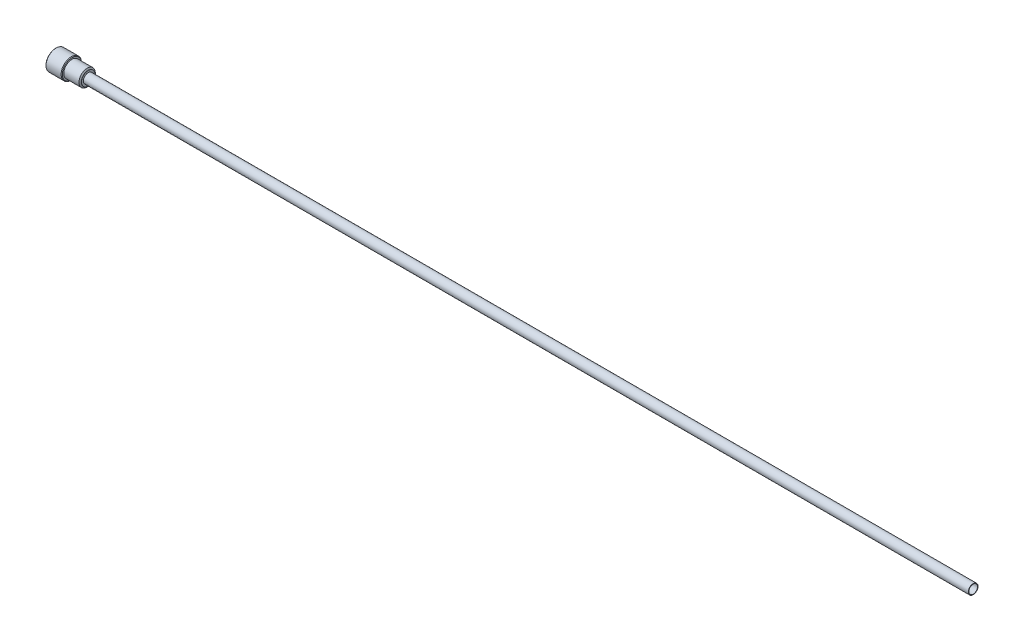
ISO-10303-21;
HEADER;
FILE_DESCRIPTION(('STEP AP214'),'2;1');
FILE_NAME('part.step','',(''),(''),'','','');
FILE_SCHEMA(('AUTOMOTIVE_DESIGN { 1 0 10303 214 1 1 1 1 }'));
ENDSEC;
DATA;
#1=APPLICATION_CONTEXT('core data for automotive mechanical design processes');
#2=APPLICATION_PROTOCOL_DEFINITION('international standard','automotive_design',2000,#1);
#3=PRODUCT_CONTEXT('',#1,'mechanical');
#4=PRODUCT('Part','Part','',(#3));
#5=PRODUCT_RELATED_PRODUCT_CATEGORY('part','',(#4));
#6=PRODUCT_DEFINITION_FORMATION('','',#4);
#7=PRODUCT_DEFINITION_CONTEXT('part definition',#1,'design');
#8=PRODUCT_DEFINITION('design','',#6,#7);
#9=PRODUCT_DEFINITION_SHAPE('','',#8);
#10=(LENGTH_UNIT() NAMED_UNIT(*) SI_UNIT(.MILLI.,.METRE.));
#11=(NAMED_UNIT(*) PLANE_ANGLE_UNIT() SI_UNIT($,.RADIAN.));
#12=(NAMED_UNIT(*) SI_UNIT($,.STERADIAN.) SOLID_ANGLE_UNIT());
#13=UNCERTAINTY_MEASURE_WITH_UNIT(LENGTH_MEASURE(1.E-05),#10,'distance_accuracy_value','');
#14=(GEOMETRIC_REPRESENTATION_CONTEXT(3) GLOBAL_UNCERTAINTY_ASSIGNED_CONTEXT((#13)) GLOBAL_UNIT_ASSIGNED_CONTEXT((#10,
#11,#12)) REPRESENTATION_CONTEXT('',''));
#15=CARTESIAN_POINT('',(0.,0.,0.));
#16=DIRECTION('',(0.,0.,1.));
#17=DIRECTION('',(1.,0.,0.));
#18=AXIS2_PLACEMENT_3D('',#15,#16,#17);
#19=CARTESIAN_POINT('',(-22.2121854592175,0.,0.));
#20=DIRECTION('',(-1.,0.,0.));
#21=DIRECTION('',(0.,0.,1.));
#22=AXIS2_PLACEMENT_3D('',#19,#20,#21);
#23=CYLINDRICAL_SURFACE('',#22,3.295);
#24=CARTESIAN_POINT('',(15.9,0.,0.));
#25=DIRECTION('',(-1.,0.,0.));
#26=DIRECTION('',(0.,0.,1.));
#27=AXIS2_PLACEMENT_3D('',#24,#25,#26);
#28=CIRCLE('',#27,3.295);
#29=CARTESIAN_POINT('',(15.9,0.,3.295));
#30=VERTEX_POINT('',#29);
#31=EDGE_CURVE('E115',#30,#30,#28,.T.);
#32=ORIENTED_EDGE('',*,*,#31,.F.);
#33=EDGE_LOOP('',(#32));
#34=FACE_BOUND('',#33,.T.);
#35=CARTESIAN_POINT('',(16.,0.,0.));
#36=DIRECTION('',(-1.,0.,0.));
#37=DIRECTION('',(0.,0.,1.));
#38=AXIS2_PLACEMENT_3D('',#35,#36,#37);
#39=CIRCLE('',#38,3.295);
#40=CARTESIAN_POINT('',(16.,0.,3.295));
#41=VERTEX_POINT('',#40);
#42=EDGE_CURVE('E133',#41,#41,#39,.T.);
#43=ORIENTED_EDGE('',*,*,#42,.T.);
#44=EDGE_LOOP('',(#43));
#45=FACE_BOUND('',#44,.T.);
#46=ADVANCED_FACE('F33',(#34,#45),#23,.T.);
#47=CARTESIAN_POINT('',(16.,3.295,0.));
#48=DIRECTION('',(-1.,0.,0.));
#49=DIRECTION('',(0.,0.,1.));
#50=AXIS2_PLACEMENT_3D('',#47,#48,#49);
#51=PLANE('',#50);
#52=ORIENTED_EDGE('',*,*,#42,.F.);
#53=EDGE_LOOP('',(#52));
#54=FACE_BOUND('',#53,.T.);
#55=CARTESIAN_POINT('',(16.,0.,0.));
#56=DIRECTION('',(-1.,0.,0.));
#57=DIRECTION('',(0.,0.,1.));
#58=AXIS2_PLACEMENT_3D('',#55,#56,#57);
#59=CIRCLE('',#58,2.3749);
#60=CARTESIAN_POINT('',(16.,0.,2.3749));
#61=VERTEX_POINT('',#60);
#62=EDGE_CURVE('E130',#61,#61,#59,.T.);
#63=ORIENTED_EDGE('',*,*,#62,.T.);
#64=EDGE_LOOP('',(#63));
#65=FACE_BOUND('',#64,.T.);
#66=ADVANCED_FACE('F272',(#54,#65),#51,.F.);
#67=CARTESIAN_POINT('',(-22.2121854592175,0.,0.));
#68=DIRECTION('',(-1.,0.,0.));
#69=DIRECTION('',(0.,0.,1.));
#70=AXIS2_PLACEMENT_3D('',#67,#68,#69);
#71=CYLINDRICAL_SURFACE('',#70,2.3749);
#72=ORIENTED_EDGE('',*,*,#62,.F.);
#73=EDGE_LOOP('',(#72));
#74=FACE_BOUND('',#73,.T.);
#75=CARTESIAN_POINT('',(450.,0.,0.));
#76=DIRECTION('',(-1.,0.,0.));
#77=DIRECTION('',(0.,0.,1.));
#78=AXIS2_PLACEMENT_3D('',#75,#76,#77);
#79=CIRCLE('',#78,2.3749);
#80=CARTESIAN_POINT('',(450.,0.,2.3749));
#81=VERTEX_POINT('',#80);
#82=EDGE_CURVE('E127',#81,#81,#79,.T.);
#83=ORIENTED_EDGE('',*,*,#82,.T.);
#84=EDGE_LOOP('',(#83));
#85=FACE_BOUND('',#84,.T.);
#86=ADVANCED_FACE('F278',(#74,#85),#71,.T.);
#87=CARTESIAN_POINT('',(450.,2.3749,0.));
#88=DIRECTION('',(-1.,0.,0.));
#89=DIRECTION('',(0.,0.,1.));
#90=AXIS2_PLACEMENT_3D('',#87,#88,#89);
#91=PLANE('',#90);
#92=ORIENTED_EDGE('',*,*,#82,.F.);
#93=EDGE_LOOP('',(#92));
#94=FACE_BOUND('',#93,.T.);
#95=CARTESIAN_POINT('',(450.,0.,0.));
#96=DIRECTION('',(-1.,0.,0.));
#97=DIRECTION('',(0.,0.,1.));
#98=AXIS2_PLACEMENT_3D('',#95,#96,#97);
#99=CIRCLE('',#98,2.12090000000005);
#100=CARTESIAN_POINT('',(450.,0.,2.12090000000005));
#101=VERTEX_POINT('',#100);
#102=EDGE_CURVE('E124',#101,#101,#99,.T.);
#103=ORIENTED_EDGE('',*,*,#102,.T.);
#104=EDGE_LOOP('',(#103));
#105=FACE_BOUND('',#104,.T.);
#106=ADVANCED_FACE('F286',(#94,#105),#91,.F.);
#107=CARTESIAN_POINT('',(-22.2121854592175,0.,0.));
#108=DIRECTION('',(-1.,0.,0.));
#109=DIRECTION('',(0.,0.,1.));
#110=AXIS2_PLACEMENT_3D('',#107,#108,#109);
#111=CYLINDRICAL_SURFACE('',#110,2.12090000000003);
#112=CARTESIAN_POINT('',(5.02821657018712,0.,0.));
#113=DIRECTION('',(-1.,0.,0.));
#114=DIRECTION('',(0.,0.,1.));
#115=AXIS2_PLACEMENT_3D('',#112,#113,#114);
#116=CIRCLE('',#115,2.12090000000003);
#117=CARTESIAN_POINT('',(5.02821657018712,0.,2.12090000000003));
#118=VERTEX_POINT('',#117);
#119=EDGE_CURVE('E114',#118,#118,#116,.T.);
#120=ORIENTED_EDGE('',*,*,#119,.T.);
#121=EDGE_LOOP('',(#120));
#122=FACE_BOUND('',#121,.T.);
#123=ORIENTED_EDGE('',*,*,#102,.F.);
#124=EDGE_LOOP('',(#123));
#125=FACE_BOUND('',#124,.T.);
#126=ADVANCED_FACE('F258',(#122,#125),#111,.F.);
#127=CARTESIAN_POINT('',(0.,2.1209,0.));
#128=DIRECTION('',(1.,0.,0.));
#129=DIRECTION('',(0.,0.,-1.));
#130=AXIS2_PLACEMENT_3D('',#127,#128,#129);
#131=PLANE('',#130);
#132=CARTESIAN_POINT('',(0.,0.,0.));
#133=DIRECTION('',(1.,0.,0.));
#134=DIRECTION('',(0.,0.,-1.));
#135=AXIS2_PLACEMENT_3D('',#132,#133,#134);
#136=CIRCLE('',#135,3.59999999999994);
#137=CARTESIAN_POINT('',(0.,0.,-3.59999999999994));
#138=VERTEX_POINT('',#137);
#139=EDGE_CURVE('E148',#138,#138,#136,.T.);
#140=ORIENTED_EDGE('',*,*,#139,.T.);
#141=EDGE_LOOP('',(#140));
#142=FACE_BOUND('',#141,.T.);
#143=CARTESIAN_POINT('',(0.,0.,0.));
#144=DIRECTION('',(1.,0.,0.));
#145=DIRECTION('',(0.,0.,-1.));
#146=AXIS2_PLACEMENT_3D('',#143,#144,#145);
#147=CIRCLE('',#146,4.70000000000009);
#148=CARTESIAN_POINT('',(0.,0.,-4.70000000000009));
#149=VERTEX_POINT('',#148);
#150=EDGE_CURVE('E145',#149,#149,#147,.F.);
#151=ORIENTED_EDGE('',*,*,#150,.T.);
#152=EDGE_LOOP('',(#151));
#153=FACE_BOUND('',#152,.T.);
#154=ADVANCED_FACE('F254',(#142,#153),#131,.F.);
#155=CARTESIAN_POINT('',(-22.2121854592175,0.,0.));
#156=DIRECTION('',(-1.,0.,0.));
#157=DIRECTION('',(0.,0.,1.));
#158=AXIS2_PLACEMENT_3D('',#155,#156,#157);
#159=CYLINDRICAL_SURFACE('',#158,5.);
#160=CARTESIAN_POINT('',(7.69999999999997,0.,0.));
#161=DIRECTION('',(-1.,0.,0.));
#162=DIRECTION('',(0.,0.,1.));
#163=AXIS2_PLACEMENT_3D('',#160,#161,#162);
#164=CIRCLE('',#163,5.);
#165=CARTESIAN_POINT('',(7.69999999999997,0.,5.));
#166=VERTEX_POINT('',#165);
#167=EDGE_CURVE('E139',#166,#166,#164,.T.);
#168=ORIENTED_EDGE('',*,*,#167,.T.);
#169=EDGE_LOOP('',(#168));
#170=FACE_BOUND('',#169,.T.);
#171=CARTESIAN_POINT('',(0.299999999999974,0.,0.));
#172=DIRECTION('',(1.,0.,0.));
#173=DIRECTION('',(0.,0.,-1.));
#174=AXIS2_PLACEMENT_3D('',#171,#172,#173);
#175=CIRCLE('',#174,5.);
#176=CARTESIAN_POINT('',(0.299999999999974,0.,-5.));
#177=VERTEX_POINT('',#176);
#178=EDGE_CURVE('E136',#177,#177,#175,.T.);
#179=ORIENTED_EDGE('',*,*,#178,.T.);
#180=EDGE_LOOP('',(#179));
#181=FACE_BOUND('',#180,.T.);
#182=ADVANCED_FACE('F257',(#170,#181),#159,.T.);
#183=CARTESIAN_POINT('',(8.,4.,0.));
#184=DIRECTION('',(-1.,0.,0.));
#185=DIRECTION('',(0.,0.,1.));
#186=AXIS2_PLACEMENT_3D('',#183,#184,#185);
#187=PLANE('',#186);
#188=CARTESIAN_POINT('',(8.,0.,0.));
#189=DIRECTION('',(-1.,0.,0.));
#190=DIRECTION('',(0.,0.,1.));
#191=AXIS2_PLACEMENT_3D('',#188,#189,#190);
#192=CIRCLE('',#191,4.69999999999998);
#193=CARTESIAN_POINT('',(8.,0.,4.69999999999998));
#194=VERTEX_POINT('',#193);
#195=EDGE_CURVE('E142',#194,#194,#192,.F.);
#196=ORIENTED_EDGE('',*,*,#195,.T.);
#197=EDGE_LOOP('',(#196));
#198=FACE_BOUND('',#197,.T.);
#199=CARTESIAN_POINT('',(8.,0.,0.));
#200=DIRECTION('',(-1.,0.,0.));
#201=DIRECTION('',(0.,0.,1.));
#202=AXIS2_PLACEMENT_3D('',#199,#200,#201);
#203=CIRCLE('',#202,4.);
#204=CARTESIAN_POINT('',(8.,0.,4.));
#205=VERTEX_POINT('',#204);
#206=EDGE_CURVE('E121',#205,#205,#203,.T.);
#207=ORIENTED_EDGE('',*,*,#206,.T.);
#208=EDGE_LOOP('',(#207));
#209=FACE_BOUND('',#208,.T.);
#210=ADVANCED_FACE('F296',(#198,#209),#187,.F.);
#211=CARTESIAN_POINT('',(-22.2121854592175,0.,0.));
#212=DIRECTION('',(-1.,0.,0.));
#213=DIRECTION('',(0.,0.,1.));
#214=AXIS2_PLACEMENT_3D('',#211,#212,#213);
#215=CYLINDRICAL_SURFACE('',#214,4.);
#216=ORIENTED_EDGE('',*,*,#206,.F.);
#217=EDGE_LOOP('',(#216));
#218=FACE_BOUND('',#217,.T.);
#219=CARTESIAN_POINT('',(15.4929680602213,0.,0.));
#220=DIRECTION('',(-1.,0.,0.));
#221=DIRECTION('',(0.,0.,1.));
#222=AXIS2_PLACEMENT_3D('',#219,#220,#221);
#223=CIRCLE('',#222,4.);
#224=CARTESIAN_POINT('',(15.4929680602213,0.,4.));
#225=VERTEX_POINT('',#224);
#226=EDGE_CURVE('E118',#225,#225,#223,.T.);
#227=ORIENTED_EDGE('',*,*,#226,.T.);
#228=EDGE_LOOP('',(#227));
#229=FACE_BOUND('',#228,.T.);
#230=ADVANCED_FACE('F299',(#218,#229),#215,.T.);
#231=CARTESIAN_POINT('',(15.9,0.,0.));
#232=DIRECTION('',(-1.,0.,0.));
#233=DIRECTION('',(0.,0.,1.));
#234=AXIS2_PLACEMENT_3D('',#231,#232,#233);
#235=CONICAL_SURFACE('',#234,3.295,1.04719755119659);
#236=ORIENTED_EDGE('',*,*,#226,.F.);
#237=EDGE_LOOP('',(#236));
#238=FACE_BOUND('',#237,.T.);
#239=ORIENTED_EDGE('',*,*,#31,.T.);
#240=EDGE_LOOP('',(#239));
#241=FACE_BOUND('',#240,.T.);
#242=ADVANCED_FACE('F195',(#238,#241),#235,.T.);
#243=CARTESIAN_POINT('',(7.69999999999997,0.,0.));
#244=DIRECTION('',(-1.,0.,0.));
#245=DIRECTION('',(0.,0.,1.));
#246=AXIS2_PLACEMENT_3D('',#243,#244,#245);
#247=CONICAL_SURFACE('',#246,5.,0.785398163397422);
#248=ORIENTED_EDGE('',*,*,#195,.F.);
#249=EDGE_LOOP('',(#248));
#250=FACE_BOUND('',#249,.T.);
#251=ORIENTED_EDGE('',*,*,#167,.F.);
#252=EDGE_LOOP('',(#251));
#253=FACE_BOUND('',#252,.T.);
#254=ADVANCED_FACE('F263',(#250,#253),#247,.T.);
#255=CARTESIAN_POINT('',(0.,0.,0.));
#256=DIRECTION('',(1.,0.,0.));
#257=DIRECTION('',(0.,0.,-1.));
#258=AXIS2_PLACEMENT_3D('',#255,#256,#257);
#259=CONICAL_SURFACE('',#258,4.70000000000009,0.785398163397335);
#260=CARTESIAN_POINT('',(0.299999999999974,0.,-5.));
#261=CARTESIAN_POINT('',(0.296874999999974,0.,-4.996875));
#262=CARTESIAN_POINT('',(0.293749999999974,0.,-4.99375));
#263=CARTESIAN_POINT('',(0.287499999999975,0.,-4.9875));
#264=CARTESIAN_POINT('',(0.284374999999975,0.,-4.984375));
#265=CARTESIAN_POINT('',(0.278124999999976,0.,-4.97812500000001));
#266=CARTESIAN_POINT('',(0.274999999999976,0.,-4.97500000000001));
#267=CARTESIAN_POINT('',(0.268749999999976,0.,-4.96875000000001));
#268=CARTESIAN_POINT('',(0.265624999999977,0.,-4.96562500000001));
#269=CARTESIAN_POINT('',(0.259374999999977,0.,-4.95937500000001));
#270=CARTESIAN_POINT('',(0.256249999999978,0.,-4.95625000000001));
#271=CARTESIAN_POINT('',(0.249999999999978,0.,-4.95000000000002));
#272=CARTESIAN_POINT('',(0.246874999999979,0.,-4.94687500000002));
#273=CARTESIAN_POINT('',(0.240624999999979,0.,-4.94062500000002));
#274=CARTESIAN_POINT('',(0.237499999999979,0.,-4.93750000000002));
#275=CARTESIAN_POINT('',(0.23124999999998,0.,-4.93125000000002));
#276=CARTESIAN_POINT('',(0.22812499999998,0.,-4.92812500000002));
#277=CARTESIAN_POINT('',(0.221874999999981,0.,-4.92187500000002));
#278=CARTESIAN_POINT('',(0.218749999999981,0.,-4.91875000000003));
#279=CARTESIAN_POINT('',(0.212499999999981,0.,-4.91250000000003));
#280=CARTESIAN_POINT('',(0.209374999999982,0.,-4.90937500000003));
#281=CARTESIAN_POINT('',(0.203124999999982,0.,-4.90312500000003));
#282=CARTESIAN_POINT('',(0.199999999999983,0.,-4.90000000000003));
#283=CARTESIAN_POINT('',(0.193749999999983,0.,-4.89375000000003));
#284=CARTESIAN_POINT('',(0.190624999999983,0.,-4.89062500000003));
#285=CARTESIAN_POINT('',(0.184374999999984,0.,-4.88437500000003));
#286=CARTESIAN_POINT('',(0.181249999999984,0.,-4.88125000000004));
#287=CARTESIAN_POINT('',(0.174999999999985,0.,-4.87500000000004));
#288=CARTESIAN_POINT('',(0.171874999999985,0.,-4.87187500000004));
#289=CARTESIAN_POINT('',(0.165624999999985,0.,-4.86562500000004));
#290=CARTESIAN_POINT('',(0.162499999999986,0.,-4.86250000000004));
#291=CARTESIAN_POINT('',(0.156249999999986,0.,-4.85625000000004));
#292=CARTESIAN_POINT('',(0.153124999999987,0.,-4.85312500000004));
#293=CARTESIAN_POINT('',(0.146874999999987,0.,-4.84687500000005));
#294=CARTESIAN_POINT('',(0.143749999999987,0.,-4.84375000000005));
#295=CARTESIAN_POINT('',(0.137499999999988,0.,-4.83750000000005));
#296=CARTESIAN_POINT('',(0.134374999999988,0.,-4.83437500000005));
#297=CARTESIAN_POINT('',(0.128124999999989,0.,-4.82812500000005));
#298=CARTESIAN_POINT('',(0.124999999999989,0.,-4.82500000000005));
#299=CARTESIAN_POINT('',(0.11874999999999,0.,-4.81875000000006));
#300=CARTESIAN_POINT('',(0.11562499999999,0.,-4.81562500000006));
#301=CARTESIAN_POINT('',(0.10937499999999,0.,-4.80937500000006));
#302=CARTESIAN_POINT('',(0.106249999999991,0.,-4.80625000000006));
#303=CARTESIAN_POINT('',(0.0999999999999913,0.,-4.80000000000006));
#304=CARTESIAN_POINT('',(0.0968749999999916,0.,-4.79687500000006));
#305=CARTESIAN_POINT('',(0.0906249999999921,0.,-4.79062500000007));
#306=CARTESIAN_POINT('',(0.0874999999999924,0.,-4.78750000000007));
#307=CARTESIAN_POINT('',(0.0812499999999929,0.,-4.78125000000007));
#308=CARTESIAN_POINT('',(0.0781249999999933,0.,-4.77812500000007));
#309=CARTESIAN_POINT('',(0.0718749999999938,0.,-4.77187500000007));
#310=CARTESIAN_POINT('',(0.0687499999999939,0.,-4.76875000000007));
#311=CARTESIAN_POINT('',(0.0624999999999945,0.,-4.76250000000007));
#312=CARTESIAN_POINT('',(0.0593749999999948,0.,-4.75937500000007));
#313=CARTESIAN_POINT('',(0.0531249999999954,0.,-4.75312500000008));
#314=CARTESIAN_POINT('',(0.0499999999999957,0.,-4.75000000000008));
#315=CARTESIAN_POINT('',(0.0437499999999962,0.,-4.74375000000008));
#316=CARTESIAN_POINT('',(0.0406249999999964,0.,-4.74062500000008));
#317=CARTESIAN_POINT('',(0.034374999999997,0.,-4.73437500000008));
#318=CARTESIAN_POINT('',(0.0312499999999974,0.,-4.73125000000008));
#319=CARTESIAN_POINT('',(0.0249999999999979,0.,-4.72500000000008));
#320=CARTESIAN_POINT('',(0.021874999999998,0.,-4.72187500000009));
#321=CARTESIAN_POINT('',(0.0156249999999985,0.,-4.71562500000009));
#322=CARTESIAN_POINT('',(0.0124999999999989,0.,-4.71250000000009));
#323=CARTESIAN_POINT('',(0.00624999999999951,0.,-4.70625000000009));
#324=CARTESIAN_POINT('',(0.00312499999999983,0.,-4.70312500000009));
#325=CARTESIAN_POINT('',(0.,0.,-4.70000000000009));
#326=B_SPLINE_CURVE_WITH_KNOTS('',3,(#260,#261,#262,#263,#264,#265,#266,#267,#268,#269,#270,
#271,#272,#273,#274,#275,#276,#277,#278,#279,#280,#281,#282,#283,#284,#285,#286,#287,#288,#289,
#290,#291,#292,#293,#294,#295,#296,#297,#298,#299,#300,#301,#302,#303,#304,#305,#306,#307,#308,
#309,#310,#311,#312,#313,#314,#315,#316,#317,#318,#319,#320,#321,#322,#323,#324,#325),
.UNSPECIFIED.,.F.,.F.,(4,2,2,2,2,2,2,2,2,2,2,2,2,2,2,2,2,2,2,2,2,2,2,2,2,2,2,2,2,2,2,2,4),(0.,
0.0132582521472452,0.0265165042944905,0.0397747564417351,0.0530330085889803,0.0662912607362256,
0.0795495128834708,0.092807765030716,0.106066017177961,0.119324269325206,0.132582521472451,
0.145840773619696,0.159099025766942,0.172357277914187,0.185615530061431,0.198873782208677,
0.212132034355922,0.225390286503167,0.238648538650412,0.251906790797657,0.265165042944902,
0.278423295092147,0.291681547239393,0.304939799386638,0.318198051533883,0.331456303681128,
0.344714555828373,0.357972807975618,0.371231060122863,0.384489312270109,0.397747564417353,
0.411005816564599,0.424264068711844),.UNSPECIFIED.);
#327=EDGE_CURVE('BSEAM192',#177,#149,#326,.T.);
#328=ORIENTED_EDGE('',*,*,#178,.F.);
#329=ORIENTED_EDGE('',*,*,#150,.F.);
#330=ORIENTED_EDGE('',*,*,#327,.T.);
#331=ORIENTED_EDGE('',*,*,#327,.F.);
#332=EDGE_LOOP('',(#328,#330,#329,#331));
#333=FACE_BOUND('',#332,.T.);
#334=ADVANCED_FACE('F192',(#333),#259,.T.);
#335=CARTESIAN_POINT('',(6.3025818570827,0.,0.));
#336=DIRECTION('',(-1.,0.,0.));
#337=DIRECTION('',(0.,0.,1.));
#338=AXIS2_PLACEMENT_3D('',#335,#336,#337);
#339=CONICAL_SURFACE('',#338,0.,1.02974425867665);
#340=CARTESIAN_POINT('',(4.22107023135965,-0.000199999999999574,3.46421708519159));
#341=CARTESIAN_POINT('',(4.26698710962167,0.132112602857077,3.38782636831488));
#342=CARTESIAN_POINT('',(4.30876587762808,0.26566228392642,3.3107214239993));
#343=CARTESIAN_POINT('',(4.38167047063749,0.535274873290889,3.15506052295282));
#344=CARTESIAN_POINT('',(4.41276776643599,0.671343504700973,3.07650126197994));
#345=CARTESIAN_POINT('',(4.46100702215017,0.941652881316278,2.92043807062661));
#346=CARTESIAN_POINT('',(4.47850101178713,1.0758447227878,2.84296237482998));
#347=CARTESIAN_POINT('',(4.49916676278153,1.34489733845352,2.6876247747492));
#348=CARTESIAN_POINT('',(4.50235797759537,1.47975695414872,2.60976353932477));
#349=CARTESIAN_POINT('',(4.49471261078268,1.73054660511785,2.46497006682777));
#350=CARTESIAN_POINT('',(4.48574911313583,1.84652340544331,2.39801082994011));
#351=CARTESIAN_POINT('',(4.45767276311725,2.07765523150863,2.26456680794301));
#352=CARTESIAN_POINT('',(4.43854966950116,2.19280930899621,2.19808257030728));
#353=CARTESIAN_POINT('',(4.39086934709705,2.42444293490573,2.06434883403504));
#354=CARTESIAN_POINT('',(4.36209782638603,2.54088851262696,1.99711894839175));
#355=CARTESIAN_POINT('',(4.29691322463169,2.77191308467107,1.86373684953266));
#356=CARTESIAN_POINT('',(4.26051663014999,2.88649554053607,1.7975826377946));
#357=CARTESIAN_POINT('',(4.22107023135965,3.0002,1.73193533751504));
#358=B_SPLINE_CURVE_WITH_KNOTS('',3,(#340,#341,#342,#343,#344,#345,#346,#347,#348,#349,#350,
#351,#352,#353,#354,#355,#356,#357),.UNSPECIFIED.,.F.,.F.,(4,2,2,2,2,2,2,2,4),(0.,
0.478808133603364,0.958885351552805,1.42608235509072,1.8926437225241,2.29488982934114,
2.69754218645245,3.10980561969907,3.52118671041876),.UNSPECIFIED.);
#359=CARTESIAN_POINT('',(4.22113961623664,0.,3.46410161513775));
#360=VERTEX_POINT('',#359);
#361=CARTESIAN_POINT('',(4.22113961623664,3.,1.73205080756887));
#362=VERTEX_POINT('',#361);
#363=EDGE_CURVE('E184',#360,#362,#358,.T.);
#364=ORIENTED_EDGE('',*,*,#363,.T.);
#365=CARTESIAN_POINT('',(2.94477995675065,3.,-4.71479898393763));
#366=CARTESIAN_POINT('',(3.01121991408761,3.,-4.58370308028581));
#367=CARTESIAN_POINT('',(3.07705344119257,3.,-4.45229465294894));
#368=CARTESIAN_POINT('',(3.20716664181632,3.,-4.18868592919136));
#369=CARTESIAN_POINT('',(3.27144606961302,3.,-4.05648551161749));
#370=CARTESIAN_POINT('',(3.39844150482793,3.,-3.7904285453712));
#371=CARTESIAN_POINT('',(3.46114681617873,3.,-3.65656687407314));
#372=CARTESIAN_POINT('',(3.5841190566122,3.,-3.38773242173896));
#373=CARTESIAN_POINT('',(3.6443861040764,3.,-3.25275969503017));
#374=CARTESIAN_POINT('',(3.76394163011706,3.,-2.97660596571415));
#375=CARTESIAN_POINT('',(3.82311746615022,3.,-2.83537593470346));
#376=CARTESIAN_POINT('',(3.93719887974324,3.,-2.55116960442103));
#377=CARTESIAN_POINT('',(3.99210394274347,3.,-2.40819309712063));
#378=CARTESIAN_POINT('',(4.0962375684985,3.,-2.12050600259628));
#379=CARTESIAN_POINT('',(4.14547776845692,3.,-1.97579966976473));
#380=CARTESIAN_POINT('',(4.23673357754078,3.,-1.6841477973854));
#381=CARTESIAN_POINT('',(4.2787515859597,3.,-1.53720301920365));
#382=CARTESIAN_POINT('',(4.35333457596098,3.,-1.24176505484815));
#383=CARTESIAN_POINT('',(4.38595115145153,3.,-1.0932851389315));
#384=CARTESIAN_POINT('',(4.43986098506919,3.,-0.794255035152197));
#385=CARTESIAN_POINT('',(4.46115599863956,3.,-0.643705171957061));
#386=CARTESIAN_POINT('',(4.49037242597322,3.,-0.343490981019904));
#387=CARTESIAN_POINT('',(4.49848386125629,3.,-0.193845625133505));
#388=CARTESIAN_POINT('',(4.50112614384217,3.,0.105589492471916));
#389=CARTESIAN_POINT('',(4.49565615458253,3.,0.255379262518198));
#390=CARTESIAN_POINT('',(4.47582425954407,3.,0.502486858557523));
#391=CARTESIAN_POINT('',(4.46516995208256,3.,0.600123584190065));
#392=CARTESIAN_POINT('',(4.43869588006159,3.,0.794698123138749));
#393=CARTESIAN_POINT('',(4.42287555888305,3.,0.891635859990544));
#394=CARTESIAN_POINT('',(4.36843968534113,3.,1.18122712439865));
#395=CARTESIAN_POINT('',(4.32285555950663,3.,1.37258842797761));
#396=CARTESIAN_POINT('',(4.24338859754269,3.,1.65899316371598));
#397=CARTESIAN_POINT('',(4.21462482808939,3.,1.75554065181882));
#398=CARTESIAN_POINT('',(4.15399286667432,3.,1.94766511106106));
#399=CARTESIAN_POINT('',(4.12212464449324,3.,2.04324207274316));
#400=CARTESIAN_POINT('',(4.05578647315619,3.,2.23345757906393));
#401=CARTESIAN_POINT('',(4.02131708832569,3.,2.32809632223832));
#402=CARTESIAN_POINT('',(3.95018359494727,3.,2.5165374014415));
#403=CARTESIAN_POINT('',(3.91351958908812,3.,2.61033977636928));
#404=CARTESIAN_POINT('',(3.78808471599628,3.,2.92219580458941));
#405=CARTESIAN_POINT('',(3.69522004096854,3.,3.13860254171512));
#406=CARTESIAN_POINT('',(3.5027342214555,3.,3.5684042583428));
#407=CARTESIAN_POINT('',(3.40311143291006,3.,3.78179848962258));
#408=CARTESIAN_POINT('',(3.19908029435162,3.,4.20647730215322));
#409=CARTESIAN_POINT('',(3.09466836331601,3.,4.41776015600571));
#410=CARTESIAN_POINT('',(2.88247936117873,3.,4.83859525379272));
#411=CARTESIAN_POINT('',(2.77470261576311,3.,5.04814766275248));
#412=CARTESIAN_POINT('',(2.55637462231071,3.,5.46650729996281));
#413=CARTESIAN_POINT('',(2.44581676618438,3.,5.67531107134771));
#414=CARTESIAN_POINT('',(2.22281071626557,3.,6.091910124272));
#415=CARTESIAN_POINT('',(2.11036248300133,3.,6.29970538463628));
#416=CARTESIAN_POINT('',(1.7709626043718,3.,6.92173213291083));
#417=CARTESIAN_POINT('',(1.54185878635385,3.,7.33478835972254));
#418=CARTESIAN_POINT('',(1.11423523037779,3.,8.09793721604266));
#419=CARTESIAN_POINT('',(0.916204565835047,3.,8.44830529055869));
#420=CARTESIAN_POINT('',(0.518265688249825,3.,9.14803179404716));
#421=CARTESIAN_POINT('',(0.318357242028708,3.,9.4973900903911));
#422=CARTESIAN_POINT('',(-0.0818282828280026,3.,10.1936400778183));
#423=CARTESIAN_POINT('',(-0.282098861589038,3.,10.5405355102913));
#424=CARTESIAN_POINT('',(-0.683633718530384,3.,11.2336865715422));
#425=CARTESIAN_POINT('',(-0.884897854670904,3.,11.5799422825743));
#426=CARTESIAN_POINT('',(-1.08651888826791,3.,11.925989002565));
#427=B_SPLINE_CURVE_WITH_KNOTS('',3,(#365,#366,#367,#368,#369,#370,#371,#372,#373,#374,#375,
#376,#377,#378,#379,#380,#381,#382,#383,#384,#385,#386,#387,#388,#389,#390,#391,#392,#393,#394,
#395,#396,#397,#398,#399,#400,#401,#402,#403,#404,#405,#406,#407,#408,#409,#410,#411,#412,#413,
#414,#415,#416,#417,#418,#419,#420,#421,#422,#423,#424,#425,#426),.UNSPECIFIED.,.F.,.F.,(4,2,2,
2,2,2,2,2,2,2,2,2,2,2,2,2,2,2,2,2,2,2,2,2,2,2,2,2,2,2,4),(0.,0.440917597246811,
0.881904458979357,1.32534637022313,1.76876672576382,2.22809242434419,2.68747337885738,
3.14589311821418,3.60416026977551,4.05986241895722,4.51549388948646,4.96449792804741,
5.41352962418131,5.70804182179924,6.00258576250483,6.5918843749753,6.89407829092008,
7.19627514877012,7.49840663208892,7.80052398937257,8.50679329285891,9.21323503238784,
9.92021390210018,10.6271245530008,11.335912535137,12.0447153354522,13.4616976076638,
14.6690720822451,15.876598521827,17.078263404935,18.2797612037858),.UNSPECIFIED.);
#428=CARTESIAN_POINT('',(4.22113961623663,3.,-1.73205080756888));
#429=VERTEX_POINT('',#428);
#430=EDGE_CURVE('E93',#362,#429,#427,.F.);
#431=ORIENTED_EDGE('',*,*,#430,.T.);
#432=CARTESIAN_POINT('',(4.22107023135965,3.0002,-1.73193533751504));
#433=CARTESIAN_POINT('',(4.26698710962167,2.86788739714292,-1.80832605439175));
#434=CARTESIAN_POINT('',(4.30876587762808,2.73433771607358,-1.88543099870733));
#435=CARTESIAN_POINT('',(4.38167047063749,2.46472512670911,-2.04109189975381));
#436=CARTESIAN_POINT('',(4.41276776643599,2.32865649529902,-2.11965116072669));
#437=CARTESIAN_POINT('',(4.46100702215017,2.05834711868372,-2.27571435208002));
#438=CARTESIAN_POINT('',(4.47850101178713,1.9241552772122,-2.35319004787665));
#439=CARTESIAN_POINT('',(4.49916676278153,1.65510266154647,-2.50852764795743));
#440=CARTESIAN_POINT('',(4.50235797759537,1.52024304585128,-2.58638888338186));
#441=CARTESIAN_POINT('',(4.49471261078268,1.26945339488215,-2.73118235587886));
#442=CARTESIAN_POINT('',(4.48574911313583,1.15347659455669,-2.79814159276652));
#443=CARTESIAN_POINT('',(4.45767276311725,0.922344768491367,-2.93158561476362));
#444=CARTESIAN_POINT('',(4.43854966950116,0.807190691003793,-2.99806985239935));
#445=CARTESIAN_POINT('',(4.39086934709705,0.57555706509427,-3.13180358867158));
#446=CARTESIAN_POINT('',(4.36209782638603,0.459111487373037,-3.19903347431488));
#447=CARTESIAN_POINT('',(4.29691322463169,0.228086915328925,-3.33241557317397));
#448=CARTESIAN_POINT('',(4.26051663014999,0.113504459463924,-3.39856978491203));
#449=CARTESIAN_POINT('',(4.22107023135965,-0.000200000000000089,-3.46421708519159));
#450=B_SPLINE_CURVE_WITH_KNOTS('',3,(#432,#433,#434,#435,#436,#437,#438,#439,#440,#441,#442,
#443,#444,#445,#446,#447,#448,#449),.UNSPECIFIED.,.F.,.F.,(4,2,2,2,2,2,2,2,4),(0.,
0.478808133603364,0.958885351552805,1.42608235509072,1.8926437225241,2.29488982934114,
2.69754218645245,3.10980561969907,3.52118671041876),.UNSPECIFIED.);
#451=CARTESIAN_POINT('',(4.22113961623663,0.,-3.46410161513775));
#452=VERTEX_POINT('',#451);
#453=EDGE_CURVE('E86',#429,#452,#450,.T.);
#454=ORIENTED_EDGE('',*,*,#453,.T.);
#455=CARTESIAN_POINT('',(4.22107023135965,0.000200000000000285,-3.46421708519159));
#456=CARTESIAN_POINT('',(4.26698710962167,-0.132112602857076,-3.38782636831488));
#457=CARTESIAN_POINT('',(4.30876587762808,-0.265662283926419,-3.3107214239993));
#458=CARTESIAN_POINT('',(4.38167047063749,-0.535274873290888,-3.15506052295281));
#459=CARTESIAN_POINT('',(4.41276776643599,-0.671343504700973,-3.07650126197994));
#460=CARTESIAN_POINT('',(4.46100702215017,-0.941652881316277,-2.92043807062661));
#461=CARTESIAN_POINT('',(4.47850101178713,-1.0758447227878,-2.84296237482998));
#462=CARTESIAN_POINT('',(4.49916676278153,-1.34489733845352,-2.6876247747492));
#463=CARTESIAN_POINT('',(4.50235797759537,-1.47975695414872,-2.60976353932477));
#464=CARTESIAN_POINT('',(4.49471261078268,-1.73054660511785,-2.46497006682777));
#465=CARTESIAN_POINT('',(4.48574911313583,-1.84652340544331,-2.39801082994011));
#466=CARTESIAN_POINT('',(4.45767276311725,-2.07765523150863,-2.26456680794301));
#467=CARTESIAN_POINT('',(4.43854966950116,-2.1928093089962,-2.19808257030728));
#468=CARTESIAN_POINT('',(4.39086934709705,-2.42444293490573,-2.06434883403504));
#469=CARTESIAN_POINT('',(4.36209782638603,-2.54088851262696,-1.99711894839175));
#470=CARTESIAN_POINT('',(4.29691322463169,-2.77191308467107,-1.86373684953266));
#471=CARTESIAN_POINT('',(4.26051663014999,-2.88649554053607,-1.79758263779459));
#472=CARTESIAN_POINT('',(4.22107023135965,-3.0002,-1.73193533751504));
#473=B_SPLINE_CURVE_WITH_KNOTS('',3,(#455,#456,#457,#458,#459,#460,#461,#462,#463,#464,#465,
#466,#467,#468,#469,#470,#471,#472),.UNSPECIFIED.,.F.,.F.,(4,2,2,2,2,2,2,2,4),(0.,
0.478808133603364,0.958885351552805,1.42608235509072,1.89264372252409,2.29488982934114,
2.69754218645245,3.10980561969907,3.52118671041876),.UNSPECIFIED.);
#474=CARTESIAN_POINT('',(4.22113961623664,-3.,-1.73205080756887));
#475=VERTEX_POINT('',#474);
#476=EDGE_CURVE('E90',#452,#475,#473,.T.);
#477=ORIENTED_EDGE('',*,*,#476,.T.);
#478=CARTESIAN_POINT('',(2.94477995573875,-3.,-4.71479898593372));
#479=CARTESIAN_POINT('',(3.01121991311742,-3.,-4.5837030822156));
#480=CARTESIAN_POINT('',(3.07705344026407,-3.,-4.45229465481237));
#481=CARTESIAN_POINT('',(3.20716664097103,-3.,-4.1886859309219));
#482=CARTESIAN_POINT('',(3.27144606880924,-3.,-4.05648551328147));
#483=CARTESIAN_POINT('',(3.39844150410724,-3.,-3.79042854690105));
#484=CARTESIAN_POINT('',(3.46114681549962,-3.,-3.65656687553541));
#485=CARTESIAN_POINT('',(3.5841190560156,-3.,-3.38773242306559));
#486=CARTESIAN_POINT('',(3.64438610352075,-3.,-3.25275969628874));
#487=CARTESIAN_POINT('',(3.76394162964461,-3.,-2.97660596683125));
#488=CARTESIAN_POINT('',(3.82311746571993,-3.,-2.8353759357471));
#489=CARTESIAN_POINT('',(3.93719887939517,-3.,-2.55116960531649));
#490=CARTESIAN_POINT('',(3.99210394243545,-3.,-2.4081930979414));
#491=CARTESIAN_POINT('',(4.09623756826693,-3.,-2.12050600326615));
#492=CARTESIAN_POINT('',(4.14547776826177,-3.,-1.97579967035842));
#493=CARTESIAN_POINT('',(4.23673357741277,-3.,-1.68414779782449));
#494=CARTESIAN_POINT('',(4.27875158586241,-3.,-1.53720301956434));
#495=CARTESIAN_POINT('',(4.35333457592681,-3.,-1.24176505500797));
#496=CARTESIAN_POINT('',(4.38595115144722,-3.,-1.0932851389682));
#497=CARTESIAN_POINT('',(4.43986098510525,-3.,-0.794255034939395));
#498=CARTESIAN_POINT('',(4.46115599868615,-3.,-0.64370517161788));
#499=CARTESIAN_POINT('',(4.49037242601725,-3.,-0.343490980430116));
#500=CARTESIAN_POINT('',(4.49848386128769,-3.,-0.193845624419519));
#501=CARTESIAN_POINT('',(4.50112614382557,-3.,0.105589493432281));
#502=CARTESIAN_POINT('',(4.49565615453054,-3.,0.255379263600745));
#503=CARTESIAN_POINT('',(4.47582425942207,-3.,0.502486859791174));
#504=CARTESIAN_POINT('',(4.46516995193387,-3.,0.600123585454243));
#505=CARTESIAN_POINT('',(4.43869587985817,-3.,0.794698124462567));
#506=CARTESIAN_POINT('',(4.4228755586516,-3.,0.891635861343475));
#507=CARTESIAN_POINT('',(4.36843968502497,-3.,1.18122712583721));
#508=CARTESIAN_POINT('',(4.32285555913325,-3.,1.37258842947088));
#509=CARTESIAN_POINT('',(4.24338859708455,-3.,1.65899316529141));
#510=CARTESIAN_POINT('',(4.21462482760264,-3.,1.75554065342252));
#511=CARTESIAN_POINT('',(4.15399286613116,-3.,1.9476651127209));
#512=CARTESIAN_POINT('',(4.12212464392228,-3.,2.0432420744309));
#513=CARTESIAN_POINT('',(4.05578647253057,-3.,2.2334575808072));
#514=CARTESIAN_POINT('',(4.02131708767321,-3.,2.32809632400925));
#515=CARTESIAN_POINT('',(3.95018359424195,-3.,2.5165374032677));
#516=CARTESIAN_POINT('',(3.91351958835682,-3.,2.6103397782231));
#517=CARTESIAN_POINT('',(3.78808471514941,-3.,2.92219580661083));
#518=CARTESIAN_POINT('',(3.69522004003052,-3.,3.13860254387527));
#519=CARTESIAN_POINT('',(3.50273422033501,-3.,3.56840426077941));
#520=CARTESIAN_POINT('',(3.40311143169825,-2.99999999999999,3.78179849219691));
#521=CARTESIAN_POINT('',(3.19908029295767,-2.99999999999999,4.20647730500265));
#522=CARTESIAN_POINT('',(3.09466836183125,-2.99999999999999,4.4177601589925));
#523=CARTESIAN_POINT('',(2.88247935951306,-2.99999999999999,4.83859525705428));
#524=CARTESIAN_POINT('',(2.77470261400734,-2.99999999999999,5.04814766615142));
#525=CARTESIAN_POINT('',(2.55637462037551,-2.99999999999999,5.46650730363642));
#526=CARTESIAN_POINT('',(2.44581676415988,-2.99999999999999,5.6753110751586));
#527=CARTESIAN_POINT('',(2.2228107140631,-2.99999999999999,6.09191012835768));
#528=CARTESIAN_POINT('',(2.1103624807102,-2.99999999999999,6.29970538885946));
#529=CARTESIAN_POINT('',(1.77096260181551,-2.99999999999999,6.92173213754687));
#530=CARTESIAN_POINT('',(1.5418587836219,-2.99999999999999,7.33478836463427));
#531=CARTESIAN_POINT('',(1.1142352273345,-2.99999999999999,8.09793722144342));
#532=CARTESIAN_POINT('',(0.916204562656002,-2.99999999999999,8.44830529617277));
#533=CARTESIAN_POINT('',(0.518265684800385,-2.99999999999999,9.14803180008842));
#534=CARTESIAN_POINT('',(0.318357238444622,-2.99999999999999,9.49739009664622));
#535=CARTESIAN_POINT('',(-0.0818282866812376,-2.99999999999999,10.1936400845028));
#536=CARTESIAN_POINT('',(-0.282098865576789,-2.99999999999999,10.5405355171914));
#537=CARTESIAN_POINT('',(-0.683633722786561,-2.99999999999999,11.2336865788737));
#538=CARTESIAN_POINT('',(-0.884897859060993,-2.99999999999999,11.5799422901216));
#539=CARTESIAN_POINT('',(-1.08651889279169,-2.99999999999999,11.9259890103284));
#540=B_SPLINE_CURVE_WITH_KNOTS('',3,(#478,#479,#480,#481,#482,#483,#484,#485,#486,#487,#488,
#489,#490,#491,#492,#493,#494,#495,#496,#497,#498,#499,#500,#501,#502,#503,#504,#505,#506,#507,
#508,#509,#510,#511,#512,#513,#514,#515,#516,#517,#518,#519,#520,#521,#522,#523,#524,#525,#526,
#527,#528,#529,#530,#531,#532,#533,#534,#535,#536,#537,#538,#539),.UNSPECIFIED.,.F.,.F.,(4,2,2,
2,2,2,2,2,2,2,2,2,2,2,2,2,2,2,2,2,2,2,2,2,2,2,2,2,2,2,4),(0.,0.440917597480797,
0.881904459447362,1.32534637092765,1.76876672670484,2.22809242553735,2.68747338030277,
3.14589311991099,3.60416027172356,4.05986242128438,4.51549389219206,4.96449793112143,
5.41352962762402,5.70804182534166,6.00258576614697,6.59188437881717,6.89407829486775,
7.19627515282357,7.49840663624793,7.80052399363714,8.50679329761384,9.2132350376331,
9.92021390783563,10.6271245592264,11.335912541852,12.0447153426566,13.4616976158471,
14.6690720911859,15.8765985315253,17.0782634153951,18.2797612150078),.UNSPECIFIED.);
#541=CARTESIAN_POINT('',(4.22113961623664,-3.,1.73205080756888));
#542=VERTEX_POINT('',#541);
#543=EDGE_CURVE('E207',#475,#542,#540,.T.);
#544=ORIENTED_EDGE('',*,*,#543,.T.);
#545=CARTESIAN_POINT('',(4.22107023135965,-3.0002,1.73193533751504));
#546=CARTESIAN_POINT('',(4.26698710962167,-2.86788739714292,1.80832605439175));
#547=CARTESIAN_POINT('',(4.30876587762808,-2.73433771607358,1.88543099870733));
#548=CARTESIAN_POINT('',(4.38167047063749,-2.46472512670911,2.04109189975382));
#549=CARTESIAN_POINT('',(4.41276776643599,-2.32865649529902,2.11965116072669));
#550=CARTESIAN_POINT('',(4.46100702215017,-2.05834711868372,2.27571435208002));
#551=CARTESIAN_POINT('',(4.47850101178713,-1.9241552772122,2.35319004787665));
#552=CARTESIAN_POINT('',(4.49916676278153,-1.65510266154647,2.50852764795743));
#553=CARTESIAN_POINT('',(4.50235797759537,-1.52024304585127,2.58638888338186));
#554=CARTESIAN_POINT('',(4.49471261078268,-1.26945339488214,2.73118235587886));
#555=CARTESIAN_POINT('',(4.48574911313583,-1.15347659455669,2.79814159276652));
#556=CARTESIAN_POINT('',(4.45767276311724,-0.922344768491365,2.93158561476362));
#557=CARTESIAN_POINT('',(4.43854966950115,-0.807190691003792,2.99806985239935));
#558=CARTESIAN_POINT('',(4.39086934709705,-0.575557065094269,3.13180358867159));
#559=CARTESIAN_POINT('',(4.36209782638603,-0.459111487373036,3.19903347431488));
#560=CARTESIAN_POINT('',(4.29691322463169,-0.228086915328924,3.33241557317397));
#561=CARTESIAN_POINT('',(4.26051663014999,-0.113504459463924,3.39856978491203));
#562=CARTESIAN_POINT('',(4.22107023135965,0.000200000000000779,3.46421708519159));
#563=B_SPLINE_CURVE_WITH_KNOTS('',3,(#545,#546,#547,#548,#549,#550,#551,#552,#553,#554,#555,
#556,#557,#558,#559,#560,#561,#562),.UNSPECIFIED.,.F.,.F.,(4,2,2,2,2,2,2,2,4),(0.,
0.478808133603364,0.958885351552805,1.42608235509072,1.8926437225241,2.29488982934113,
2.69754218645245,3.10980561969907,3.52118671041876),.UNSPECIFIED.);
#564=EDGE_CURVE('E202',#542,#360,#563,.T.);
#565=ORIENTED_EDGE('',*,*,#564,.T.);
#566=EDGE_LOOP('',(#364,#431,#454,#477,#544,#565));
#567=FACE_BOUND('',#566,.T.);
#568=ORIENTED_EDGE('',*,*,#119,.F.);
#569=EDGE_LOOP('',(#568));
#570=FACE_BOUND('',#569,.T.);
#571=ADVANCED_FACE('F88',(#567,#570),#339,.F.);
#572=CARTESIAN_POINT('',(0.,0.,0.));
#573=DIRECTION('',(-1.,0.,0.));
#574=DIRECTION('',(0.,0.,1.));
#575=AXIS2_PLACEMENT_3D('',#572,#573,#574);
#576=CONICAL_SURFACE('',#575,3.59999999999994,0.785398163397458);
#577=CARTESIAN_POINT('',(0.135782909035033,3.0002,-1.73193533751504));
#578=CARTESIAN_POINT('',(0.195270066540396,2.89707648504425,-1.79147372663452));
#579=CARTESIAN_POINT('',(0.251263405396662,2.79222861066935,-1.85200767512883));
#580=CARTESIAN_POINT('',(0.353785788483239,2.5784323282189,-1.97544301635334));
#581=CARTESIAN_POINT('',(0.400257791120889,2.46946358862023,-2.03835614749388));
#582=CARTESIAN_POINT('',(0.479865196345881,2.24973336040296,-2.16521745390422));
#583=CARTESIAN_POINT('',(0.513200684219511,2.13902782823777,-2.22913332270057));
#584=CARTESIAN_POINT('',(0.564560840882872,1.91517958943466,-2.35837216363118));
#585=CARTESIAN_POINT('',(0.582623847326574,1.80204372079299,-2.42369118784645));
#586=CARTESIAN_POINT('',(0.598921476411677,1.60705904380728,-2.536265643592));
#587=CARTESIAN_POINT('',(0.601334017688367,1.52546204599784,-2.58337569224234));
#588=CARTESIAN_POINT('',(0.597268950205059,1.36240077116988,-2.67751916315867));
#589=CARTESIAN_POINT('',(0.590788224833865,1.28093655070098,-2.72455255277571));
#590=CARTESIAN_POINT('',(0.569306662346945,1.1187798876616,-2.81817374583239));
#591=CARTESIAN_POINT('',(0.554296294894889,1.03808841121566,-2.86476099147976));
#592=CARTESIAN_POINT('',(0.516574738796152,0.878091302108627,-2.95713536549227));
#593=CARTESIAN_POINT('',(0.493864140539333,0.798785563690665,-3.00292255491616));
#594=CARTESIAN_POINT('',(0.447137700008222,0.65799385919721,-3.08420868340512));
#595=CARTESIAN_POINT('',(0.424350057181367,0.596196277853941,-3.11988753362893));
#596=CARTESIAN_POINT('',(0.375102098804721,0.473710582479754,-3.19060468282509));
#597=CARTESIAN_POINT('',(0.348641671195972,0.413022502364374,-3.22564296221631));
#598=CARTESIAN_POINT('',(0.292641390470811,0.292947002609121,-3.29496858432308));
#599=CARTESIAN_POINT('',(0.263111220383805,0.23355616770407,-3.32925789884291));
#600=CARTESIAN_POINT('',(0.201359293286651,0.115874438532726,-3.39720147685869));
#601=CARTESIAN_POINT('',(0.169139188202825,0.0575828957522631,-3.43085611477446));
#602=CARTESIAN_POINT('',(0.135782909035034,-0.000199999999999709,-3.46421708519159));
#603=B_SPLINE_CURVE_WITH_KNOTS('',3,(#577,#578,#579,#580,#581,#582,#583,#584,#585,#586,#587,
#588,#589,#590,#591,#592,#593,#594,#595,#596,#597,#598,#599,#600,#601,#602),.UNSPECIFIED.,.F.,
.F.,(4,2,2,2,2,2,2,2,2,2,2,2,4),(0.,0.399603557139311,0.801535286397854,1.19708369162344,
1.59163620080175,1.87398941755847,2.15644160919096,2.43921001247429,2.72195674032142,
2.9465751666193,3.17120044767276,3.3951375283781,3.61893808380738),.UNSPECIFIED.);
#604=CARTESIAN_POINT('',(0.135898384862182,3.,-1.73205080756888));
#605=VERTEX_POINT('',#604);
#606=CARTESIAN_POINT('',(0.135898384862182,0.,-3.46410161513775));
#607=VERTEX_POINT('',#606);
#608=EDGE_CURVE('E11',#605,#607,#603,.T.);
#609=ORIENTED_EDGE('',*,*,#608,.F.);
#610=CARTESIAN_POINT('',(-1.13993802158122,3.,-3.66974283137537));
#611=CARTESIAN_POINT('',(-1.07147299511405,3.,-3.58129180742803));
#612=CARTESIAN_POINT('',(-1.00360609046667,3.,-3.49237050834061));
#613=CARTESIAN_POINT('',(-0.86934358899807,3.,-3.31339292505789));
#614=CARTESIAN_POINT('',(-0.802948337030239,3.,-3.22333638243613));
#615=CARTESIAN_POINT('',(-0.671431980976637,3.,-3.04123654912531));
#616=CARTESIAN_POINT('',(-0.606324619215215,3.,-2.9491833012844));
#617=CARTESIAN_POINT('',(-0.478323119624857,3.,-2.76355581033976));
#618=CARTESIAN_POINT('',(-0.415428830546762,3.,-2.66998167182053));
#619=CARTESIAN_POINT('',(-0.288325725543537,3.,-2.47485638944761));
#620=CARTESIAN_POINT('',(-0.224301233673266,3.,-2.37318457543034));
#621=CARTESIAN_POINT('',(-0.100149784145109,3.,-2.16745008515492));
#622=CARTESIAN_POINT('',(-0.040023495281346,3.,-2.06338700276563));
#623=CARTESIAN_POINT('',(0.0750569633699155,3.,-1.85282870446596));
#624=CARTESIAN_POINT('',(0.130026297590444,3.,-1.74634184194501));
#625=CARTESIAN_POINT('',(0.233561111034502,3.,-1.53032370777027));
#626=CARTESIAN_POINT('',(0.282129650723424,3.,-1.4207939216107));
#627=CARTESIAN_POINT('',(0.366446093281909,3.,-1.21003765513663));
#628=CARTESIAN_POINT('',(0.403003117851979,3.,-1.10913818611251));
#629=CARTESIAN_POINT('',(0.468045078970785,3.,-0.904721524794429));
#630=CARTESIAN_POINT('',(0.496529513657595,3.,-0.801204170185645));
#631=CARTESIAN_POINT('',(0.543389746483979,3.,-0.594001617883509));
#632=CARTESIAN_POINT('',(0.561952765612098,3.,-0.490359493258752));
#633=CARTESIAN_POINT('',(0.588574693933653,3.,-0.281727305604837));
#634=CARTESIAN_POINT('',(0.596635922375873,3.,-0.176737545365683));
#635=CARTESIAN_POINT('',(0.601538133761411,3.,0.028622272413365));
#636=CARTESIAN_POINT('',(0.598882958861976,3.,0.128980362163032));
#637=CARTESIAN_POINT('',(0.583668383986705,3.,0.328937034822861));
#638=CARTESIAN_POINT('',(0.571108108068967,3.,0.428535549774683));
#639=CARTESIAN_POINT('',(0.536589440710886,3.,0.627945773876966));
#640=CARTESIAN_POINT('',(0.514463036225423,3.,0.727727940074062));
#641=CARTESIAN_POINT('',(0.462052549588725,3.,0.925075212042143));
#642=CARTESIAN_POINT('',(0.431768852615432,3.,1.02264042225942));
#643=CARTESIAN_POINT('',(0.327599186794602,3.,1.32077549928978));
#644=CARTESIAN_POINT('',(0.242239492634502,3.,1.51734805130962));
#645=CARTESIAN_POINT('',(0.0998158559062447,3.,1.80505526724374));
#646=CARTESIAN_POINT('',(0.0498340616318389,3.,1.89994102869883));
#647=CARTESIAN_POINT('',(-0.0540148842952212,3.,2.0875671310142));
#648=CARTESIAN_POINT('',(-0.107881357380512,3.,2.18030784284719));
#649=CARTESIAN_POINT('',(-0.215989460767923,3.,2.35936675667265));
#650=CARTESIAN_POINT('',(-0.270081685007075,3.,2.44577618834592));
#651=CARTESIAN_POINT('',(-0.380576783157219,3.,2.61711215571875));
#652=CARTESIAN_POINT('',(-0.436979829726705,3.,2.70203857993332));
#653=CARTESIAN_POINT('',(-0.551226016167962,3.,2.8699193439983));
#654=CARTESIAN_POINT('',(-0.609054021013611,3.,2.95288402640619));
#655=CARTESIAN_POINT('',(-0.726265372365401,3.,3.11767419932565));
#656=CARTESIAN_POINT('',(-0.785648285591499,3.,3.19949999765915));
#657=CARTESIAN_POINT('',(-0.84566801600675,3.,3.28084807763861));
#658=B_SPLINE_CURVE_WITH_KNOTS('',3,(#610,#611,#612,#613,#614,#615,#616,#617,#618,#619,#620,
#621,#622,#623,#624,#625,#626,#627,#628,#629,#630,#631,#632,#633,#634,#635,#636,#637,#638,#639,
#640,#641,#642,#643,#644,#645,#646,#647,#648,#649,#650,#651,#652,#653,#654,#655,#656,#657),
.UNSPECIFIED.,.F.,.F.,(4,2,2,2,2,2,2,2,2,2,2,2,2,2,2,2,2,2,2,2,2,2,2,4),(0.,0.335564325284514,
0.671206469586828,1.00943230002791,1.34763496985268,1.70801887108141,2.06846443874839,
2.42781448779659,2.78699208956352,3.1086697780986,3.43036746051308,3.74575864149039,
4.06108015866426,4.36175334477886,4.66245312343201,4.96866357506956,5.2748595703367,
5.91579781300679,6.23750489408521,6.55915591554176,6.86495017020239,7.17076731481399,
7.47413733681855,7.77742370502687),.UNSPECIFIED.);
#659=CARTESIAN_POINT('',(0.135898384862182,3.,1.73205080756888));
#660=VERTEX_POINT('',#659);
#661=EDGE_CURVE('E153',#660,#605,#658,.F.);
#662=ORIENTED_EDGE('',*,*,#661,.F.);
#663=CARTESIAN_POINT('',(0.135782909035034,-0.000199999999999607,3.46421708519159));
#664=CARTESIAN_POINT('',(0.195270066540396,0.10292351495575,3.40467869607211));
#665=CARTESIAN_POINT('',(0.251263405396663,0.207771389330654,3.3441447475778));
#666=CARTESIAN_POINT('',(0.353785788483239,0.421567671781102,3.22070940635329));
#667=CARTESIAN_POINT('',(0.400257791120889,0.530536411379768,3.15779627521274));
#668=CARTESIAN_POINT('',(0.479865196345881,0.750266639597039,3.03093496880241));
#669=CARTESIAN_POINT('',(0.513200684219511,0.860972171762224,2.96701910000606));
#670=CARTESIAN_POINT('',(0.564560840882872,1.08482041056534,2.83778025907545));
#671=CARTESIAN_POINT('',(0.582623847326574,1.19795627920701,2.77246123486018));
#672=CARTESIAN_POINT('',(0.598921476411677,1.39294095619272,2.65988677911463));
#673=CARTESIAN_POINT('',(0.601334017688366,1.47453795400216,2.61277673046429));
#674=CARTESIAN_POINT('',(0.597268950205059,1.63759922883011,2.51863325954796));
#675=CARTESIAN_POINT('',(0.590788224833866,1.71906344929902,2.47159986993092));
#676=CARTESIAN_POINT('',(0.569306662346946,1.8812201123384,2.37797867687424));
#677=CARTESIAN_POINT('',(0.554296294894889,1.96191158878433,2.33139143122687));
#678=CARTESIAN_POINT('',(0.516574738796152,2.12190869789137,2.23901705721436));
#679=CARTESIAN_POINT('',(0.493864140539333,2.20121443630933,2.19322986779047));
#680=CARTESIAN_POINT('',(0.447137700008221,2.34200614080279,2.11194373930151));
#681=CARTESIAN_POINT('',(0.424350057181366,2.40380372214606,2.0762648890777));
#682=CARTESIAN_POINT('',(0.375102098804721,2.52628941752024,2.00554773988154));
#683=CARTESIAN_POINT('',(0.348641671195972,2.58697749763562,1.97050946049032));
#684=CARTESIAN_POINT('',(0.292641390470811,2.70705299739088,1.90118383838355));
#685=CARTESIAN_POINT('',(0.263111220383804,2.76644383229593,1.86689452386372));
#686=CARTESIAN_POINT('',(0.20135929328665,2.88412556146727,1.79895094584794));
#687=CARTESIAN_POINT('',(0.169139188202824,2.94241710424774,1.76529630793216));
#688=CARTESIAN_POINT('',(0.135782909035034,3.0002,1.73193533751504));
#689=B_SPLINE_CURVE_WITH_KNOTS('',3,(#663,#664,#665,#666,#667,#668,#669,#670,#671,#672,#673,
#674,#675,#676,#677,#678,#679,#680,#681,#682,#683,#684,#685,#686,#687,#688),.UNSPECIFIED.,.F.,
.F.,(4,2,2,2,2,2,2,2,2,2,2,2,4),(0.,0.399603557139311,0.801535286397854,1.19708369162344,
1.59163620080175,1.87398941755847,2.15644160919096,2.43921001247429,2.72195674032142,
2.9465751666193,3.17120044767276,3.39513752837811,3.61893808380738),.UNSPECIFIED.);
#690=CARTESIAN_POINT('',(0.135898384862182,0.,3.46410161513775));
#691=VERTEX_POINT('',#690);
#692=EDGE_CURVE('E160',#691,#660,#689,.T.);
#693=ORIENTED_EDGE('',*,*,#692,.F.);
#694=CARTESIAN_POINT('',(0.135782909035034,-3.0002,1.73193533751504));
#695=CARTESIAN_POINT('',(0.195270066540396,-2.89707648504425,1.79147372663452));
#696=CARTESIAN_POINT('',(0.251263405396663,-2.79222861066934,1.85200767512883));
#697=CARTESIAN_POINT('',(0.353785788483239,-2.57843232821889,1.97544301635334));
#698=CARTESIAN_POINT('',(0.400257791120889,-2.46946358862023,2.03835614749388));
#699=CARTESIAN_POINT('',(0.479865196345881,-2.24973336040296,2.16521745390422));
#700=CARTESIAN_POINT('',(0.513200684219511,-2.13902782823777,2.22913332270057));
#701=CARTESIAN_POINT('',(0.564560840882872,-1.91517958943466,2.35837216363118));
#702=CARTESIAN_POINT('',(0.582623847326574,-1.80204372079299,2.42369118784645));
#703=CARTESIAN_POINT('',(0.598921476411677,-1.60705904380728,2.536265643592));
#704=CARTESIAN_POINT('',(0.601334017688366,-1.52546204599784,2.58337569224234));
#705=CARTESIAN_POINT('',(0.597268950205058,-1.36240077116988,2.67751916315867));
#706=CARTESIAN_POINT('',(0.590788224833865,-1.28093655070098,2.72455255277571));
#707=CARTESIAN_POINT('',(0.569306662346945,-1.1187798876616,2.81817374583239));
#708=CARTESIAN_POINT('',(0.554296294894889,-1.03808841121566,2.86476099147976));
#709=CARTESIAN_POINT('',(0.516574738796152,-0.878091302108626,2.95713536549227));
#710=CARTESIAN_POINT('',(0.493864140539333,-0.798785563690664,3.00292255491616));
#711=CARTESIAN_POINT('',(0.447137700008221,-0.657993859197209,3.08420868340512));
#712=CARTESIAN_POINT('',(0.424350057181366,-0.59619627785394,3.11988753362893));
#713=CARTESIAN_POINT('',(0.375102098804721,-0.473710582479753,3.19060468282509));
#714=CARTESIAN_POINT('',(0.348641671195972,-0.413022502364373,3.22564296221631));
#715=CARTESIAN_POINT('',(0.292641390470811,-0.292947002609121,3.29496858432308));
#716=CARTESIAN_POINT('',(0.263111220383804,-0.233556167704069,3.32925789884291));
#717=CARTESIAN_POINT('',(0.20135929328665,-0.115874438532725,3.39720147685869));
#718=CARTESIAN_POINT('',(0.169139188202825,-0.0575828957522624,3.43085611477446));
#719=CARTESIAN_POINT('',(0.135782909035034,0.000200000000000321,3.46421708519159));
#720=B_SPLINE_CURVE_WITH_KNOTS('',3,(#694,#695,#696,#697,#698,#699,#700,#701,#702,#703,#704,
#705,#706,#707,#708,#709,#710,#711,#712,#713,#714,#715,#716,#717,#718,#719),.UNSPECIFIED.,.F.,
.F.,(4,2,2,2,2,2,2,2,2,2,2,2,4),(0.,0.39960355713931,0.801535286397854,1.19708369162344,
1.59163620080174,1.87398941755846,2.15644160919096,2.43921001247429,2.72195674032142,
2.94657516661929,3.17120044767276,3.3951375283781,3.61893808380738),.UNSPECIFIED.);
#721=CARTESIAN_POINT('',(0.135898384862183,-3.,1.73205080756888));
#722=VERTEX_POINT('',#721);
#723=EDGE_CURVE('E229',#722,#691,#720,.T.);
#724=ORIENTED_EDGE('',*,*,#723,.F.);
#725=CARTESIAN_POINT('',(-1.13993802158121,-3.,-3.66974283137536));
#726=CARTESIAN_POINT('',(-1.07147299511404,-3.,-3.58129180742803));
#727=CARTESIAN_POINT('',(-1.00360609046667,-3.,-3.49237050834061));
#728=CARTESIAN_POINT('',(-0.869343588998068,-3.,-3.31339292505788));
#729=CARTESIAN_POINT('',(-0.802948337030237,-3.,-3.22333638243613));
#730=CARTESIAN_POINT('',(-0.671431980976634,-3.,-3.0412365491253));
#731=CARTESIAN_POINT('',(-0.606324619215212,-3.,-2.94918330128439));
#732=CARTESIAN_POINT('',(-0.478323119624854,-3.,-2.76355581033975));
#733=CARTESIAN_POINT('',(-0.415428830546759,-3.,-2.66998167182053));
#734=CARTESIAN_POINT('',(-0.288325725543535,-3.,-2.47485638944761));
#735=CARTESIAN_POINT('',(-0.224301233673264,-3.,-2.37318457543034));
#736=CARTESIAN_POINT('',(-0.100149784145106,-3.,-2.16745008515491));
#737=CARTESIAN_POINT('',(-0.0400234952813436,-3.,-2.06338700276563));
#738=CARTESIAN_POINT('',(0.0750569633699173,-3.,-1.85282870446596));
#739=CARTESIAN_POINT('',(0.130026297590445,-3.,-1.746341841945));
#740=CARTESIAN_POINT('',(0.233561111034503,-3.,-1.53032370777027));
#741=CARTESIAN_POINT('',(0.282129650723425,-3.,-1.4207939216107));
#742=CARTESIAN_POINT('',(0.36644609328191,-3.,-1.21003765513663));
#743=CARTESIAN_POINT('',(0.40300311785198,-3.,-1.10913818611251));
#744=CARTESIAN_POINT('',(0.468045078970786,-3.,-0.904721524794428));
#745=CARTESIAN_POINT('',(0.496529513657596,-3.,-0.801204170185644));
#746=CARTESIAN_POINT('',(0.54338974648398,-3.,-0.594001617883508));
#747=CARTESIAN_POINT('',(0.5619527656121,-3.,-0.490359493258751));
#748=CARTESIAN_POINT('',(0.588574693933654,-3.,-0.281727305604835));
#749=CARTESIAN_POINT('',(0.596635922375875,-3.,-0.176737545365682));
#750=CARTESIAN_POINT('',(0.601538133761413,-3.,0.0286222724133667));
#751=CARTESIAN_POINT('',(0.598882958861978,-3.,0.128980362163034));
#752=CARTESIAN_POINT('',(0.583668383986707,-3.,0.328937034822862));
#753=CARTESIAN_POINT('',(0.571108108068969,-3.,0.428535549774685));
#754=CARTESIAN_POINT('',(0.536589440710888,-3.,0.627945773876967));
#755=CARTESIAN_POINT('',(0.514463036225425,-3.,0.727727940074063));
#756=CARTESIAN_POINT('',(0.462052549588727,-3.,0.925075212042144));
#757=CARTESIAN_POINT('',(0.431768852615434,-3.,1.02264042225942));
#758=CARTESIAN_POINT('',(0.327599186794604,-3.,1.32077549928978));
#759=CARTESIAN_POINT('',(0.242239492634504,-3.,1.51734805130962));
#760=CARTESIAN_POINT('',(0.0998158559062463,-3.,1.80505526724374));
#761=CARTESIAN_POINT('',(0.0498340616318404,-3.,1.89994102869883));
#762=CARTESIAN_POINT('',(-0.0540148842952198,-3.,2.0875671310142));
#763=CARTESIAN_POINT('',(-0.107881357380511,-3.,2.18030784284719));
#764=CARTESIAN_POINT('',(-0.215989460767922,-3.,2.35936675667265));
#765=CARTESIAN_POINT('',(-0.270081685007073,-3.,2.44577618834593));
#766=CARTESIAN_POINT('',(-0.380576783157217,-3.,2.61711215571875));
#767=CARTESIAN_POINT('',(-0.436979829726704,-3.,2.70203857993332));
#768=CARTESIAN_POINT('',(-0.55122601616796,-3.,2.8699193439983));
#769=CARTESIAN_POINT('',(-0.60905402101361,-3.,2.95288402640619));
#770=CARTESIAN_POINT('',(-0.726265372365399,-3.,3.11767419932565));
#771=CARTESIAN_POINT('',(-0.785648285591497,-3.,3.19949999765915));
#772=CARTESIAN_POINT('',(-0.845668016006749,-3.,3.28084807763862));
#773=B_SPLINE_CURVE_WITH_KNOTS('',3,(#725,#726,#727,#728,#729,#730,#731,#732,#733,#734,#735,
#736,#737,#738,#739,#740,#741,#742,#743,#744,#745,#746,#747,#748,#749,#750,#751,#752,#753,#754,
#755,#756,#757,#758,#759,#760,#761,#762,#763,#764,#765,#766,#767,#768,#769,#770,#771,#772),
.UNSPECIFIED.,.F.,.F.,(4,2,2,2,2,2,2,2,2,2,2,2,2,2,2,2,2,2,2,2,2,2,2,4),(0.,0.335564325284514,
0.671206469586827,1.00943230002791,1.34763496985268,1.70801887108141,2.06846443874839,
2.42781448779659,2.78699208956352,3.1086697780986,3.43036746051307,3.74575864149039,
4.06108015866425,4.36175334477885,4.662453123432,4.96866357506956,5.2748595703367,
5.91579781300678,6.23750489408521,6.55915591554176,6.86495017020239,7.17076731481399,
7.47413733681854,7.77742370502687),.UNSPECIFIED.);
#774=CARTESIAN_POINT('',(0.135898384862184,-3.,-1.73205080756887));
#775=VERTEX_POINT('',#774);
#776=EDGE_CURVE('E56',#775,#722,#773,.T.);
#777=ORIENTED_EDGE('',*,*,#776,.F.);
#778=CARTESIAN_POINT('',(0.135782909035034,0.000200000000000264,-3.46421708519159));
#779=CARTESIAN_POINT('',(0.195270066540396,-0.102923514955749,-3.40467869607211));
#780=CARTESIAN_POINT('',(0.251263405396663,-0.207771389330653,-3.3441447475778));
#781=CARTESIAN_POINT('',(0.35378578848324,-0.421567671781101,-3.22070940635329));
#782=CARTESIAN_POINT('',(0.40025779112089,-0.530536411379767,-3.15779627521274));
#783=CARTESIAN_POINT('',(0.479865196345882,-0.750266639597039,-3.0309349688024));
#784=CARTESIAN_POINT('',(0.513200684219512,-0.860972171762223,-2.96701910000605));
#785=CARTESIAN_POINT('',(0.564560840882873,-1.08482041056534,-2.83778025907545));
#786=CARTESIAN_POINT('',(0.582623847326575,-1.19795627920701,-2.77246123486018));
#787=CARTESIAN_POINT('',(0.598921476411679,-1.39294095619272,-2.65988677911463));
#788=CARTESIAN_POINT('',(0.601334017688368,-1.47453795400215,-2.61277673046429));
#789=CARTESIAN_POINT('',(0.59726895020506,-1.63759922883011,-2.51863325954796));
#790=CARTESIAN_POINT('',(0.590788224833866,-1.71906344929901,-2.47159986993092));
#791=CARTESIAN_POINT('',(0.569306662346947,-1.8812201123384,-2.37797867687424));
#792=CARTESIAN_POINT('',(0.55429629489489,-1.96191158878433,-2.33139143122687));
#793=CARTESIAN_POINT('',(0.516574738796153,-2.12190869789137,-2.23901705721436));
#794=CARTESIAN_POINT('',(0.493864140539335,-2.20121443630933,-2.19322986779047));
#795=CARTESIAN_POINT('',(0.447137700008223,-2.34200614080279,-2.11194373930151));
#796=CARTESIAN_POINT('',(0.424350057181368,-2.40380372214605,-2.0762648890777));
#797=CARTESIAN_POINT('',(0.375102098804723,-2.52628941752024,-2.00554773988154));
#798=CARTESIAN_POINT('',(0.348641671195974,-2.58697749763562,-1.97050946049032));
#799=CARTESIAN_POINT('',(0.292641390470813,-2.70705299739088,-1.90118383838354));
#800=CARTESIAN_POINT('',(0.263111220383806,-2.76644383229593,-1.86689452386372));
#801=CARTESIAN_POINT('',(0.201359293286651,-2.88412556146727,-1.79895094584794));
#802=CARTESIAN_POINT('',(0.169139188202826,-2.94241710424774,-1.76529630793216));
#803=CARTESIAN_POINT('',(0.135782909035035,-3.0002,-1.73193533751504));
#804=B_SPLINE_CURVE_WITH_KNOTS('',3,(#778,#779,#780,#781,#782,#783,#784,#785,#786,#787,#788,
#789,#790,#791,#792,#793,#794,#795,#796,#797,#798,#799,#800,#801,#802,#803),.UNSPECIFIED.,.F.,
.F.,(4,2,2,2,2,2,2,2,2,2,2,2,4),(0.,0.399603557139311,0.801535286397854,1.19708369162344,
1.59163620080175,1.87398941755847,2.15644160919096,2.43921001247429,2.72195674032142,
2.94657516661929,3.17120044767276,3.39513752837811,3.61893808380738),.UNSPECIFIED.);
#805=EDGE_CURVE('E46',#607,#775,#804,.T.);
#806=ORIENTED_EDGE('',*,*,#805,.F.);
#807=EDGE_LOOP('',(#609,#662,#693,#724,#777,#806));
#808=FACE_BOUND('',#807,.T.);
#809=ORIENTED_EDGE('',*,*,#139,.F.);
#810=EDGE_LOOP('',(#809));
#811=FACE_BOUND('',#810,.T.);
#812=ADVANCED_FACE('F35',(#808,#811),#576,.F.);
#813=CARTESIAN_POINT('',(450.001,3.,-1.73205080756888));
#814=DIRECTION('',(0.,0.5,-0.866025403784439));
#815=DIRECTION('',(0.,0.866025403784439,0.5));
#816=AXIS2_PLACEMENT_3D('',#813,#814,#815);
#817=PLANE('',#816);
#818=ORIENTED_EDGE('',*,*,#453,.F.);
#819=DIRECTION('',(-1.,0.,0.));
#820=VECTOR('',#819,1.);
#821=CARTESIAN_POINT('',(450.001,3.,-1.73205080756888));
#822=LINE('',#821,#820);
#823=EDGE_CURVE('E112',#429,#605,#822,.T.);
#824=ORIENTED_EDGE('',*,*,#823,.T.);
#825=ORIENTED_EDGE('',*,*,#608,.T.);
#826=DIRECTION('',(-1.,0.,0.));
#827=VECTOR('',#826,1.);
#828=CARTESIAN_POINT('',(450.001,0.,-3.46410161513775));
#829=LINE('',#828,#827);
#830=EDGE_CURVE('E98',#452,#607,#829,.T.);
#831=ORIENTED_EDGE('',*,*,#830,.F.);
#832=EDGE_LOOP('',(#818,#824,#825,#831));
#833=FACE_BOUND('',#832,.T.);
#834=ADVANCED_FACE('F107',(#833),#817,.F.);
#835=CARTESIAN_POINT('',(450.001,0.,-3.46410161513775));
#836=DIRECTION('',(0.,-0.5,-0.866025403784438));
#837=DIRECTION('',(0.,0.866025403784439,-0.5));
#838=AXIS2_PLACEMENT_3D('',#835,#836,#837);
#839=PLANE('',#838);
#840=ORIENTED_EDGE('',*,*,#476,.F.);
#841=ORIENTED_EDGE('',*,*,#830,.T.);
#842=ORIENTED_EDGE('',*,*,#805,.T.);
#843=DIRECTION('',(-1.,0.,0.));
#844=VECTOR('',#843,1.);
#845=CARTESIAN_POINT('',(450.001,-3.,-1.73205080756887));
#846=LINE('',#845,#844);
#847=EDGE_CURVE('E105',#475,#775,#846,.T.);
#848=ORIENTED_EDGE('',*,*,#847,.F.);
#849=EDGE_LOOP('',(#840,#841,#842,#848));
#850=FACE_BOUND('',#849,.T.);
#851=ADVANCED_FACE('F103',(#850),#839,.F.);
#852=CARTESIAN_POINT('',(450.001,-3.,-1.73205080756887));
#853=DIRECTION('',(0.,-1.,0.));
#854=DIRECTION('',(0.,0.,-1.));
#855=AXIS2_PLACEMENT_3D('',#852,#853,#854);
#856=PLANE('',#855);
#857=ORIENTED_EDGE('',*,*,#543,.F.);
#858=ORIENTED_EDGE('',*,*,#847,.T.);
#859=ORIENTED_EDGE('',*,*,#776,.T.);
#860=DIRECTION('',(-1.,0.,0.));
#861=VECTOR('',#860,1.);
#862=CARTESIAN_POINT('',(450.001,-3.,1.73205080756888));
#863=LINE('',#862,#861);
#864=EDGE_CURVE('E212',#542,#722,#863,.T.);
#865=ORIENTED_EDGE('',*,*,#864,.F.);
#866=EDGE_LOOP('',(#857,#858,#859,#865));
#867=FACE_BOUND('',#866,.T.);
#868=ADVANCED_FACE('F217',(#867),#856,.F.);
#869=CARTESIAN_POINT('',(450.001,-3.,1.73205080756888));
#870=DIRECTION('',(0.,-0.5,0.866025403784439));
#871=DIRECTION('',(0.,-0.866025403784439,-0.5));
#872=AXIS2_PLACEMENT_3D('',#869,#870,#871);
#873=PLANE('',#872);
#874=ORIENTED_EDGE('',*,*,#564,.F.);
#875=ORIENTED_EDGE('',*,*,#864,.T.);
#876=ORIENTED_EDGE('',*,*,#723,.T.);
#877=DIRECTION('',(-1.,0.,0.));
#878=VECTOR('',#877,1.);
#879=CARTESIAN_POINT('',(450.001,0.,3.46410161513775));
#880=LINE('',#879,#878);
#881=EDGE_CURVE('E244',#360,#691,#880,.T.);
#882=ORIENTED_EDGE('',*,*,#881,.F.);
#883=EDGE_LOOP('',(#874,#875,#876,#882));
#884=FACE_BOUND('',#883,.T.);
#885=ADVANCED_FACE('F220',(#884),#873,.F.);
#886=CARTESIAN_POINT('',(450.001,0.,3.46410161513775));
#887=DIRECTION('',(0.,0.5,0.866025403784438));
#888=DIRECTION('',(0.,-0.866025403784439,0.5));
#889=AXIS2_PLACEMENT_3D('',#886,#887,#888);
#890=PLANE('',#889);
#891=ORIENTED_EDGE('',*,*,#363,.F.);
#892=ORIENTED_EDGE('',*,*,#881,.T.);
#893=ORIENTED_EDGE('',*,*,#692,.T.);
#894=DIRECTION('',(-1.,0.,0.));
#895=VECTOR('',#894,1.);
#896=CARTESIAN_POINT('',(450.001,3.,1.73205080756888));
#897=LINE('',#896,#895);
#898=EDGE_CURVE('E180',#362,#660,#897,.T.);
#899=ORIENTED_EDGE('',*,*,#898,.F.);
#900=EDGE_LOOP('',(#891,#892,#893,#899));
#901=FACE_BOUND('',#900,.T.);
#902=ADVANCED_FACE('F169',(#901),#890,.F.);
#903=CARTESIAN_POINT('',(450.001,3.,1.73205080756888));
#904=DIRECTION('',(0.,1.,0.));
#905=DIRECTION('',(0.,0.,1.));
#906=AXIS2_PLACEMENT_3D('',#903,#904,#905);
#907=PLANE('',#906);
#908=ORIENTED_EDGE('',*,*,#430,.F.);
#909=ORIENTED_EDGE('',*,*,#898,.T.);
#910=ORIENTED_EDGE('',*,*,#661,.T.);
#911=ORIENTED_EDGE('',*,*,#823,.F.);
#912=EDGE_LOOP('',(#908,#909,#910,#911));
#913=FACE_BOUND('',#912,.T.);
#914=ADVANCED_FACE('F166',(#913),#907,.F.);
#915=CLOSED_SHELL('',(#46,#66,#86,#106,#126,#154,#182,#210,#230,#242,#254,#334,#571,#812,#834,
#851,#868,#885,#902,#914));
#916=MANIFOLD_SOLID_BREP('B2',#915);
#917=ADVANCED_BREP_SHAPE_REPRESENTATION('',(#18,#916),#14);
#918=SHAPE_DEFINITION_REPRESENTATION(#9,#917);
ENDSEC;
END-ISO-10303-21;
